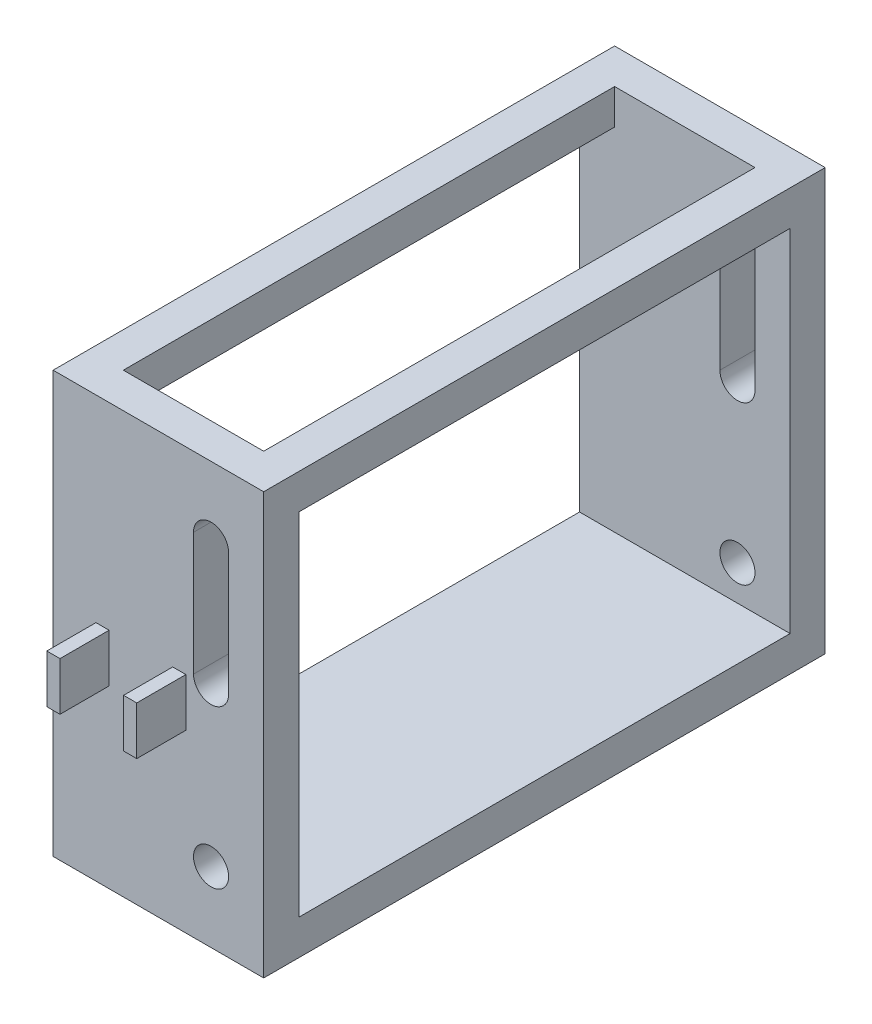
ISO-10303-21;
HEADER;
FILE_DESCRIPTION(('STEP AP214'),'2;1');
FILE_NAME('part.step','',(''),(''),'','','');
FILE_SCHEMA(('AUTOMOTIVE_DESIGN { 1 0 10303 214 1 1 1 1 }'));
ENDSEC;
DATA;
#1=APPLICATION_CONTEXT('core data for automotive mechanical design processes');
#2=APPLICATION_PROTOCOL_DEFINITION('international standard','automotive_design',2000,#1);
#3=PRODUCT_CONTEXT('',#1,'mechanical');
#4=PRODUCT('Part','Part','',(#3));
#5=PRODUCT_RELATED_PRODUCT_CATEGORY('part','',(#4));
#6=PRODUCT_DEFINITION_FORMATION('','',#4);
#7=PRODUCT_DEFINITION_CONTEXT('part definition',#1,'design');
#8=PRODUCT_DEFINITION('design','',#6,#7);
#9=PRODUCT_DEFINITION_SHAPE('','',#8);
#10=(LENGTH_UNIT() NAMED_UNIT(*) SI_UNIT(.MILLI.,.METRE.));
#11=(NAMED_UNIT(*) PLANE_ANGLE_UNIT() SI_UNIT($,.RADIAN.));
#12=(NAMED_UNIT(*) SI_UNIT($,.STERADIAN.) SOLID_ANGLE_UNIT());
#13=UNCERTAINTY_MEASURE_WITH_UNIT(LENGTH_MEASURE(1.E-05),#10,'distance_accuracy_value','');
#14=(GEOMETRIC_REPRESENTATION_CONTEXT(3) GLOBAL_UNCERTAINTY_ASSIGNED_CONTEXT((#13)) GLOBAL_UNIT_ASSIGNED_CONTEXT((#10,
#11,#12)) REPRESENTATION_CONTEXT('',''));
#15=CARTESIAN_POINT('',(0.,0.,0.));
#16=DIRECTION('',(0.,0.,1.));
#17=DIRECTION('',(1.,0.,0.));
#18=AXIS2_PLACEMENT_3D('',#15,#16,#17);
#19=CARTESIAN_POINT('',(0.,12.7,0.));
#20=DIRECTION('',(0.,0.,-1.));
#21=DIRECTION('',(-1.,0.,0.));
#22=AXIS2_PLACEMENT_3D('',#19,#20,#21);
#23=PLANE('',#22);
#24=DIRECTION('',(0.,-1.,0.));
#25=VECTOR('',#24,1.);
#26=CARTESIAN_POINT('',(15.494,81.026,0.));
#27=LINE('',#26,#25);
#28=CARTESIAN_POINT('',(15.494,81.026,0.));
#29=VERTEX_POINT('',#28);
#30=CARTESIAN_POINT('',(15.494,63.5635,0.));
#31=VERTEX_POINT('',#30);
#32=EDGE_CURVE('E413',#29,#31,#27,.T.);
#33=ORIENTED_EDGE('',*,*,#32,.F.);
#34=DIRECTION('',(-1.,0.,0.));
#35=VECTOR('',#34,1.);
#36=CARTESIAN_POINT('',(15.494,81.026,0.));
#37=LINE('',#36,#35);
#38=CARTESIAN_POINT('',(20.2565,81.026,0.));
#39=VERTEX_POINT('',#38);
#40=EDGE_CURVE('E419',#39,#29,#37,.T.);
#41=ORIENTED_EDGE('',*,*,#40,.F.);
#42=DIRECTION('',(0.,1.,0.));
#43=VECTOR('',#42,1.);
#44=CARTESIAN_POINT('',(20.2565,81.026,0.));
#45=LINE('',#44,#43);
#46=CARTESIAN_POINT('',(20.2565,63.5635,0.));
#47=VERTEX_POINT('',#46);
#48=EDGE_CURVE('E436',#47,#39,#45,.T.);
#49=ORIENTED_EDGE('',*,*,#48,.F.);
#50=DIRECTION('',(1.,0.,0.));
#51=VECTOR('',#50,1.);
#52=CARTESIAN_POINT('',(15.494,63.5635,0.));
#53=LINE('',#52,#51);
#54=EDGE_CURVE('E432',#31,#47,#53,.T.);
#55=ORIENTED_EDGE('',*,*,#54,.F.);
#56=EDGE_LOOP('',(#33,#41,#49,#55));
#57=FACE_BOUND('',#56,.T.);
#58=CARTESIAN_POINT('',(57.15,25.4,0.));
#59=DIRECTION('',(0.,0.,1.));
#60=DIRECTION('',(1.,0.,0.));
#61=AXIS2_PLACEMENT_3D('',#58,#59,#60);
#62=CIRCLE('',#61,6.35);
#63=CARTESIAN_POINT('',(63.5,25.4,0.));
#64=VERTEX_POINT('',#63);
#65=EDGE_CURVE('E464',#64,#64,#62,.T.);
#66=ORIENTED_EDGE('',*,*,#65,.F.);
#67=EDGE_LOOP('',(#66));
#68=FACE_BOUND('',#67,.T.);
#69=DIRECTION('',(0.,-1.,0.));
#70=VECTOR('',#69,1.);
#71=CARTESIAN_POINT('',(50.8,127.,0.));
#72=LINE('',#71,#70);
#73=CARTESIAN_POINT('',(50.8,127.,0.));
#74=VERTEX_POINT('',#73);
#75=CARTESIAN_POINT('',(50.8,82.55,0.));
#76=VERTEX_POINT('',#75);
#77=EDGE_CURVE('E489',#74,#76,#72,.T.);
#78=ORIENTED_EDGE('',*,*,#77,.F.);
#79=CARTESIAN_POINT('',(57.15,127.,0.));
#80=DIRECTION('',(0.,0.,1.));
#81=DIRECTION('',(1.,0.,0.));
#82=AXIS2_PLACEMENT_3D('',#79,#80,#81);
#83=CIRCLE('',#82,6.34999999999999);
#84=CARTESIAN_POINT('',(63.5,127.,0.));
#85=VERTEX_POINT('',#84);
#86=EDGE_CURVE('E458',#85,#74,#83,.T.);
#87=ORIENTED_EDGE('',*,*,#86,.F.);
#88=DIRECTION('',(0.,1.,0.));
#89=VECTOR('',#88,1.);
#90=CARTESIAN_POINT('',(63.5,127.,0.));
#91=LINE('',#90,#89);
#92=CARTESIAN_POINT('',(63.5,82.55,0.));
#93=VERTEX_POINT('',#92);
#94=EDGE_CURVE('E474',#93,#85,#91,.T.);
#95=ORIENTED_EDGE('',*,*,#94,.F.);
#96=CARTESIAN_POINT('',(57.15,82.55,0.));
#97=DIRECTION('',(0.,0.,1.));
#98=DIRECTION('',(1.,0.,0.));
#99=AXIS2_PLACEMENT_3D('',#96,#97,#98);
#100=CIRCLE('',#99,6.34999999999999);
#101=EDGE_CURVE('E493',#76,#93,#100,.T.);
#102=ORIENTED_EDGE('',*,*,#101,.F.);
#103=EDGE_LOOP('',(#78,#87,#95,#102));
#104=FACE_BOUND('',#103,.T.);
#105=DIRECTION('',(1.,0.,0.));
#106=VECTOR('',#105,1.);
#107=CARTESIAN_POINT('',(0.,0.,0.));
#108=LINE('',#107,#106);
#109=CARTESIAN_POINT('',(0.,0.,0.));
#110=VERTEX_POINT('',#109);
#111=CARTESIAN_POINT('',(76.2,0.,0.));
#112=VERTEX_POINT('',#111);
#113=EDGE_CURVE('E644',#110,#112,#108,.T.);
#114=ORIENTED_EDGE('',*,*,#113,.T.);
#115=DIRECTION('',(0.,-1.,0.));
#116=VECTOR('',#115,1.);
#117=CARTESIAN_POINT('',(76.2,12.7,0.));
#118=LINE('',#117,#116);
#119=CARTESIAN_POINT('',(76.2,152.4,0.));
#120=VERTEX_POINT('',#119);
#121=EDGE_CURVE('E659',#120,#112,#118,.T.);
#122=ORIENTED_EDGE('',*,*,#121,.F.);
#123=DIRECTION('',(1.,0.,0.));
#124=VECTOR('',#123,1.);
#125=CARTESIAN_POINT('',(0.,152.4,0.));
#126=LINE('',#125,#124);
#127=CARTESIAN_POINT('',(0.,152.4,0.));
#128=VERTEX_POINT('',#127);
#129=EDGE_CURVE('E583',#128,#120,#126,.T.);
#130=ORIENTED_EDGE('',*,*,#129,.F.);
#131=DIRECTION('',(0.,-1.,0.));
#132=VECTOR('',#131,1.);
#133=CARTESIAN_POINT('',(0.,12.7,0.));
#134=LINE('',#133,#132);
#135=EDGE_CURVE('E663',#128,#110,#134,.T.);
#136=ORIENTED_EDGE('',*,*,#135,.T.);
#137=EDGE_LOOP('',(#114,#122,#130,#136));
#138=FACE_BOUND('',#137,.T.);
#139=DIRECTION('',(0.,-1.,0.));
#140=VECTOR('',#139,1.);
#141=CARTESIAN_POINT('',(43.27525,81.026,0.));
#142=LINE('',#141,#140);
#143=CARTESIAN_POINT('',(43.27525,81.026,0.));
#144=VERTEX_POINT('',#143);
#145=CARTESIAN_POINT('',(43.27525,63.5635,0.));
#146=VERTEX_POINT('',#145);
#147=EDGE_CURVE('E368',#144,#146,#142,.T.);
#148=ORIENTED_EDGE('',*,*,#147,.F.);
#149=DIRECTION('',(-1.,0.,0.));
#150=VECTOR('',#149,1.);
#151=CARTESIAN_POINT('',(43.27525,81.026,0.));
#152=LINE('',#151,#150);
#153=CARTESIAN_POINT('',(48.03775,81.026,0.));
#154=VERTEX_POINT('',#153);
#155=EDGE_CURVE('E374',#154,#144,#152,.T.);
#156=ORIENTED_EDGE('',*,*,#155,.F.);
#157=DIRECTION('',(0.,1.,0.));
#158=VECTOR('',#157,1.);
#159=CARTESIAN_POINT('',(48.03775,81.026,0.));
#160=LINE('',#159,#158);
#161=CARTESIAN_POINT('',(48.03775,63.5635,0.));
#162=VERTEX_POINT('',#161);
#163=EDGE_CURVE('E391',#162,#154,#160,.T.);
#164=ORIENTED_EDGE('',*,*,#163,.F.);
#165=DIRECTION('',(1.,0.,0.));
#166=VECTOR('',#165,1.);
#167=CARTESIAN_POINT('',(43.27525,63.5635,0.));
#168=LINE('',#167,#166);
#169=EDGE_CURVE('E387',#146,#162,#168,.T.);
#170=ORIENTED_EDGE('',*,*,#169,.F.);
#171=EDGE_LOOP('',(#148,#156,#164,#170));
#172=FACE_BOUND('',#171,.T.);
#173=ADVANCED_FACE('F39',(#57,#68,#104,#138,#172),#23,.F.);
#174=CARTESIAN_POINT('',(0.,12.7,0.));
#175=DIRECTION('',(0.,-1.,0.));
#176=DIRECTION('',(0.,0.,-1.));
#177=AXIS2_PLACEMENT_3D('',#174,#175,#176);
#178=PLANE('',#177);
#179=DIRECTION('',(-1.,0.,0.));
#180=VECTOR('',#179,1.);
#181=CARTESIAN_POINT('',(0.,12.7,-12.7));
#182=LINE('',#181,#180);
#183=CARTESIAN_POINT('',(76.2,12.7,-12.7));
#184=VERTEX_POINT('',#183);
#185=CARTESIAN_POINT('',(0.,12.7,-12.7));
#186=VERTEX_POINT('',#185);
#187=EDGE_CURVE('E601',#184,#186,#182,.T.);
#188=ORIENTED_EDGE('',*,*,#187,.F.);
#189=DIRECTION('',(0.,0.,-1.));
#190=VECTOR('',#189,1.);
#191=CARTESIAN_POINT('',(76.2,12.7,0.));
#192=LINE('',#191,#190);
#193=CARTESIAN_POINT('',(76.2,12.7,-190.5));
#194=VERTEX_POINT('',#193);
#195=EDGE_CURVE('E636',#184,#194,#192,.T.);
#196=ORIENTED_EDGE('',*,*,#195,.T.);
#197=DIRECTION('',(1.,0.,0.));
#198=VECTOR('',#197,1.);
#199=CARTESIAN_POINT('',(0.,12.7,-190.5));
#200=LINE('',#199,#198);
#201=CARTESIAN_POINT('',(0.,12.7,-190.5));
#202=VERTEX_POINT('',#201);
#203=EDGE_CURVE('E617',#202,#194,#200,.T.);
#204=ORIENTED_EDGE('',*,*,#203,.F.);
#205=DIRECTION('',(0.,0.,1.));
#206=VECTOR('',#205,1.);
#207=CARTESIAN_POINT('',(0.,12.7,0.));
#208=LINE('',#207,#206);
#209=EDGE_CURVE('E633',#202,#186,#208,.T.);
#210=ORIENTED_EDGE('',*,*,#209,.T.);
#211=EDGE_LOOP('',(#188,#196,#204,#210));
#212=FACE_BOUND('',#211,.T.);
#213=ADVANCED_FACE('F739',(#212),#178,.F.);
#214=CARTESIAN_POINT('',(0.,12.7,0.));
#215=DIRECTION('',(1.,0.,0.));
#216=DIRECTION('',(0.,0.,-1.));
#217=AXIS2_PLACEMENT_3D('',#214,#215,#216);
#218=PLANE('',#217);
#219=DIRECTION('',(0.,-1.,0.));
#220=VECTOR('',#219,1.);
#221=CARTESIAN_POINT('',(0.,139.7,-190.5));
#222=LINE('',#221,#220);
#223=CARTESIAN_POINT('',(0.,139.7,-190.5));
#224=VERTEX_POINT('',#223);
#225=EDGE_CURVE('E628',#224,#202,#222,.T.);
#226=ORIENTED_EDGE('',*,*,#225,.F.);
#227=DIRECTION('',(0.,0.,1.));
#228=VECTOR('',#227,1.);
#229=CARTESIAN_POINT('',(0.,139.7,-203.2));
#230=LINE('',#229,#228);
#231=CARTESIAN_POINT('',(0.,139.7,-12.7));
#232=VERTEX_POINT('',#231);
#233=EDGE_CURVE('E573',#224,#232,#230,.T.);
#234=ORIENTED_EDGE('',*,*,#233,.T.);
#235=DIRECTION('',(0.,-1.,0.));
#236=VECTOR('',#235,1.);
#237=CARTESIAN_POINT('',(0.,139.7,-12.7));
#238=LINE('',#237,#236);
#239=EDGE_CURVE('E605',#232,#186,#238,.T.);
#240=ORIENTED_EDGE('',*,*,#239,.T.);
#241=ORIENTED_EDGE('',*,*,#209,.F.);
#242=EDGE_LOOP('',(#226,#234,#240,#241));
#243=FACE_BOUND('',#242,.T.);
#244=DIRECTION('',(0.,0.,1.));
#245=VECTOR('',#244,1.);
#246=CARTESIAN_POINT('',(0.,0.,0.));
#247=LINE('',#246,#245);
#248=CARTESIAN_POINT('',(0.,0.,-203.2));
#249=VERTEX_POINT('',#248);
#250=EDGE_CURVE('E632',#249,#110,#247,.T.);
#251=ORIENTED_EDGE('',*,*,#250,.T.);
#252=ORIENTED_EDGE('',*,*,#135,.F.);
#253=DIRECTION('',(0.,0.,1.));
#254=VECTOR('',#253,1.);
#255=CARTESIAN_POINT('',(0.,152.4,-203.2));
#256=LINE('',#255,#254);
#257=CARTESIAN_POINT('',(0.,152.4,-203.2));
#258=VERTEX_POINT('',#257);
#259=EDGE_CURVE('E578',#258,#128,#256,.T.);
#260=ORIENTED_EDGE('',*,*,#259,.F.);
#261=DIRECTION('',(0.,-1.,0.));
#262=VECTOR('',#261,1.);
#263=CARTESIAN_POINT('',(0.,12.7,-203.2));
#264=LINE('',#263,#262);
#265=EDGE_CURVE('E640',#258,#249,#264,.T.);
#266=ORIENTED_EDGE('',*,*,#265,.T.);
#267=EDGE_LOOP('',(#251,#252,#260,#266));
#268=FACE_BOUND('',#267,.T.);
#269=ADVANCED_FACE('F41',(#243,#268),#218,.F.);
#270=CARTESIAN_POINT('',(76.2,12.7,0.));
#271=DIRECTION('',(-1.,0.,0.));
#272=DIRECTION('',(0.,0.,1.));
#273=AXIS2_PLACEMENT_3D('',#270,#271,#272);
#274=PLANE('',#273);
#275=DIRECTION('',(0.,-1.,0.));
#276=VECTOR('',#275,1.);
#277=CARTESIAN_POINT('',(76.2,12.7,-203.2));
#278=LINE('',#277,#276);
#279=CARTESIAN_POINT('',(76.2,152.4,-203.2));
#280=VERTEX_POINT('',#279);
#281=CARTESIAN_POINT('',(76.2,0.,-203.2));
#282=VERTEX_POINT('',#281);
#283=EDGE_CURVE('E655',#280,#282,#278,.T.);
#284=ORIENTED_EDGE('',*,*,#283,.F.);
#285=DIRECTION('',(0.,0.,-1.));
#286=VECTOR('',#285,1.);
#287=CARTESIAN_POINT('',(76.2,152.4,0.));
#288=LINE('',#287,#286);
#289=EDGE_CURVE('E587',#120,#280,#288,.T.);
#290=ORIENTED_EDGE('',*,*,#289,.F.);
#291=ORIENTED_EDGE('',*,*,#121,.T.);
#292=DIRECTION('',(0.,0.,-1.));
#293=VECTOR('',#292,1.);
#294=CARTESIAN_POINT('',(76.2,0.,0.));
#295=LINE('',#294,#293);
#296=EDGE_CURVE('E647',#112,#282,#295,.T.);
#297=ORIENTED_EDGE('',*,*,#296,.T.);
#298=EDGE_LOOP('',(#284,#290,#291,#297));
#299=FACE_BOUND('',#298,.T.);
#300=DIRECTION('',(0.,0.,-1.));
#301=VECTOR('',#300,1.);
#302=CARTESIAN_POINT('',(76.2,139.7,0.));
#303=LINE('',#302,#301);
#304=CARTESIAN_POINT('',(76.2,139.7,-12.7));
#305=VERTEX_POINT('',#304);
#306=CARTESIAN_POINT('',(76.2,139.7,-190.5));
#307=VERTEX_POINT('',#306);
#308=EDGE_CURVE('E579',#305,#307,#303,.T.);
#309=ORIENTED_EDGE('',*,*,#308,.T.);
#310=DIRECTION('',(0.,-1.,0.));
#311=VECTOR('',#310,1.);
#312=CARTESIAN_POINT('',(76.2,139.7,-190.5));
#313=LINE('',#312,#311);
#314=EDGE_CURVE('E621',#307,#194,#313,.T.);
#315=ORIENTED_EDGE('',*,*,#314,.T.);
#316=ORIENTED_EDGE('',*,*,#195,.F.);
#317=DIRECTION('',(0.,-1.,0.));
#318=VECTOR('',#317,1.);
#319=CARTESIAN_POINT('',(76.2,139.7,-12.7));
#320=LINE('',#319,#318);
#321=EDGE_CURVE('E613',#305,#184,#320,.T.);
#322=ORIENTED_EDGE('',*,*,#321,.F.);
#323=EDGE_LOOP('',(#309,#315,#316,#322));
#324=FACE_BOUND('',#323,.T.);
#325=ADVANCED_FACE('F736',(#299,#324),#274,.F.);
#326=CARTESIAN_POINT('',(0.,12.7,-203.2));
#327=DIRECTION('',(0.,0.,1.));
#328=DIRECTION('',(1.,0.,0.));
#329=AXIS2_PLACEMENT_3D('',#326,#327,#328);
#330=PLANE('',#329);
#331=DIRECTION('',(-1.,0.,0.));
#332=VECTOR('',#331,1.);
#333=CARTESIAN_POINT('',(43.27525,81.026,-203.2));
#334=LINE('',#333,#332);
#335=CARTESIAN_POINT('',(48.03775,81.026,-203.2));
#336=VERTEX_POINT('',#335);
#337=CARTESIAN_POINT('',(43.27525,81.026,-203.2));
#338=VERTEX_POINT('',#337);
#339=EDGE_CURVE('E312',#336,#338,#334,.T.);
#340=ORIENTED_EDGE('',*,*,#339,.T.);
#341=DIRECTION('',(0.,-1.,0.));
#342=VECTOR('',#341,1.);
#343=CARTESIAN_POINT('',(43.27525,81.026,-203.2));
#344=LINE('',#343,#342);
#345=CARTESIAN_POINT('',(43.27525,63.5635,-203.2));
#346=VERTEX_POINT('',#345);
#347=EDGE_CURVE('E280',#338,#346,#344,.T.);
#348=ORIENTED_EDGE('',*,*,#347,.T.);
#349=DIRECTION('',(1.,0.,0.));
#350=VECTOR('',#349,1.);
#351=CARTESIAN_POINT('',(43.27525,63.5635,-203.2));
#352=LINE('',#351,#350);
#353=CARTESIAN_POINT('',(48.03775,63.5635,-203.2));
#354=VERTEX_POINT('',#353);
#355=EDGE_CURVE('E298',#346,#354,#352,.T.);
#356=ORIENTED_EDGE('',*,*,#355,.T.);
#357=DIRECTION('',(0.,1.,0.));
#358=VECTOR('',#357,1.);
#359=CARTESIAN_POINT('',(48.03775,81.026,-203.2));
#360=LINE('',#359,#358);
#361=EDGE_CURVE('E56',#354,#336,#360,.T.);
#362=ORIENTED_EDGE('',*,*,#361,.T.);
#363=EDGE_LOOP('',(#340,#348,#356,#362));
#364=FACE_BOUND('',#363,.T.);
#365=DIRECTION('',(-1.,0.,0.));
#366=VECTOR('',#365,1.);
#367=CARTESIAN_POINT('',(15.494,81.026,-203.2));
#368=LINE('',#367,#366);
#369=CARTESIAN_POINT('',(20.2565,81.026,-203.2));
#370=VERTEX_POINT('',#369);
#371=CARTESIAN_POINT('',(15.494,81.026,-203.2));
#372=VERTEX_POINT('',#371);
#373=EDGE_CURVE('E348',#370,#372,#368,.T.);
#374=ORIENTED_EDGE('',*,*,#373,.T.);
#375=DIRECTION('',(0.,-1.,0.));
#376=VECTOR('',#375,1.);
#377=CARTESIAN_POINT('',(15.494,81.026,-203.2));
#378=LINE('',#377,#376);
#379=CARTESIAN_POINT('',(15.494,63.5635,-203.2));
#380=VERTEX_POINT('',#379);
#381=EDGE_CURVE('E286',#372,#380,#378,.T.);
#382=ORIENTED_EDGE('',*,*,#381,.T.);
#383=DIRECTION('',(1.,0.,0.));
#384=VECTOR('',#383,1.);
#385=CARTESIAN_POINT('',(15.494,63.5635,-203.2));
#386=LINE('',#385,#384);
#387=CARTESIAN_POINT('',(20.2565,63.5635,-203.2));
#388=VERTEX_POINT('',#387);
#389=EDGE_CURVE('E332',#380,#388,#386,.T.);
#390=ORIENTED_EDGE('',*,*,#389,.T.);
#391=DIRECTION('',(0.,1.,0.));
#392=VECTOR('',#391,1.);
#393=CARTESIAN_POINT('',(20.2565,81.026,-203.2));
#394=LINE('',#393,#392);
#395=EDGE_CURVE('E64',#388,#370,#394,.T.);
#396=ORIENTED_EDGE('',*,*,#395,.T.);
#397=EDGE_LOOP('',(#374,#382,#390,#396));
#398=FACE_BOUND('',#397,.T.);
#399=CARTESIAN_POINT('',(57.15,25.4,-203.2));
#400=DIRECTION('',(0.,0.,1.));
#401=DIRECTION('',(1.,0.,0.));
#402=AXIS2_PLACEMENT_3D('',#399,#400,#401);
#403=CIRCLE('',#402,6.35);
#404=CARTESIAN_POINT('',(63.5,25.4,-203.2));
#405=VERTEX_POINT('',#404);
#406=EDGE_CURVE('E459',#405,#405,#403,.T.);
#407=ORIENTED_EDGE('',*,*,#406,.T.);
#408=EDGE_LOOP('',(#407));
#409=FACE_BOUND('',#408,.T.);
#410=DIRECTION('',(0.,1.,0.));
#411=VECTOR('',#410,1.);
#412=CARTESIAN_POINT('',(63.5,127.,-203.2));
#413=LINE('',#412,#411);
#414=CARTESIAN_POINT('',(63.5,82.55,-203.2));
#415=VERTEX_POINT('',#414);
#416=CARTESIAN_POINT('',(63.5,127.,-203.2));
#417=VERTEX_POINT('',#416);
#418=EDGE_CURVE('E482',#415,#417,#413,.T.);
#419=ORIENTED_EDGE('',*,*,#418,.T.);
#420=CARTESIAN_POINT('',(57.15,127.,-203.2));
#421=DIRECTION('',(0.,0.,1.));
#422=DIRECTION('',(1.,0.,0.));
#423=AXIS2_PLACEMENT_3D('',#420,#421,#422);
#424=CIRCLE('',#423,6.34999999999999);
#425=CARTESIAN_POINT('',(50.8,127.,-203.2));
#426=VERTEX_POINT('',#425);
#427=EDGE_CURVE('E469',#417,#426,#424,.T.);
#428=ORIENTED_EDGE('',*,*,#427,.T.);
#429=DIRECTION('',(0.,-1.,0.));
#430=VECTOR('',#429,1.);
#431=CARTESIAN_POINT('',(50.8,127.,-203.2));
#432=LINE('',#431,#430);
#433=CARTESIAN_POINT('',(50.8,82.55,-203.2));
#434=VERTEX_POINT('',#433);
#435=EDGE_CURVE('E473',#426,#434,#432,.T.);
#436=ORIENTED_EDGE('',*,*,#435,.T.);
#437=CARTESIAN_POINT('',(57.15,82.55,-203.2));
#438=DIRECTION('',(0.,0.,1.));
#439=DIRECTION('',(1.,0.,0.));
#440=AXIS2_PLACEMENT_3D('',#437,#438,#439);
#441=CIRCLE('',#440,6.34999999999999);
#442=EDGE_CURVE('E478',#434,#415,#441,.T.);
#443=ORIENTED_EDGE('',*,*,#442,.T.);
#444=EDGE_LOOP('',(#419,#428,#436,#443));
#445=FACE_BOUND('',#444,.T.);
#446=DIRECTION('',(-1.,0.,0.));
#447=VECTOR('',#446,1.);
#448=CARTESIAN_POINT('',(0.,0.,-203.2));
#449=LINE('',#448,#447);
#450=EDGE_CURVE('E637',#282,#249,#449,.T.);
#451=ORIENTED_EDGE('',*,*,#450,.T.);
#452=ORIENTED_EDGE('',*,*,#265,.F.);
#453=DIRECTION('',(-1.,0.,0.));
#454=VECTOR('',#453,1.);
#455=CARTESIAN_POINT('',(76.2,152.4,-203.2));
#456=LINE('',#455,#454);
#457=EDGE_CURVE('E574',#280,#258,#456,.T.);
#458=ORIENTED_EDGE('',*,*,#457,.F.);
#459=ORIENTED_EDGE('',*,*,#283,.T.);
#460=EDGE_LOOP('',(#451,#452,#458,#459));
#461=FACE_BOUND('',#460,.T.);
#462=ADVANCED_FACE('F753',(#364,#398,#409,#445,#461),#330,.F.);
#463=CARTESIAN_POINT('',(0.,0.,0.));
#464=DIRECTION('',(0.,-1.,0.));
#465=DIRECTION('',(0.,0.,-1.));
#466=AXIS2_PLACEMENT_3D('',#463,#464,#465);
#467=PLANE('',#466);
#468=ORIENTED_EDGE('',*,*,#250,.F.);
#469=ORIENTED_EDGE('',*,*,#450,.F.);
#470=ORIENTED_EDGE('',*,*,#296,.F.);
#471=ORIENTED_EDGE('',*,*,#113,.F.);
#472=EDGE_LOOP('',(#468,#469,#470,#471));
#473=FACE_BOUND('',#472,.T.);
#474=ADVANCED_FACE('F750',(#473),#467,.T.);
#475=CARTESIAN_POINT('',(0.,139.7,-190.5));
#476=DIRECTION('',(0.,0.,-1.));
#477=DIRECTION('',(-1.,0.,0.));
#478=AXIS2_PLACEMENT_3D('',#475,#476,#477);
#479=PLANE('',#478);
#480=CARTESIAN_POINT('',(57.15,25.4,-190.5));
#481=DIRECTION('',(0.,0.,-1.));
#482=DIRECTION('',(-1.,0.,0.));
#483=AXIS2_PLACEMENT_3D('',#480,#481,#482);
#484=CIRCLE('',#483,6.35);
#485=CARTESIAN_POINT('',(50.8,25.4,-190.5));
#486=VERTEX_POINT('',#485);
#487=EDGE_CURVE('E532',#486,#486,#484,.T.);
#488=ORIENTED_EDGE('',*,*,#487,.T.);
#489=EDGE_LOOP('',(#488));
#490=FACE_BOUND('',#489,.T.);
#491=DIRECTION('',(0.,1.,0.));
#492=VECTOR('',#491,1.);
#493=CARTESIAN_POINT('',(50.8,139.7,-190.5));
#494=LINE('',#493,#492);
#495=CARTESIAN_POINT('',(50.8,82.55,-190.5));
#496=VERTEX_POINT('',#495);
#497=CARTESIAN_POINT('',(50.8,127.,-190.5));
#498=VERTEX_POINT('',#497);
#499=EDGE_CURVE('E463',#496,#498,#494,.T.);
#500=ORIENTED_EDGE('',*,*,#499,.T.);
#501=CARTESIAN_POINT('',(57.15,127.,-190.5));
#502=DIRECTION('',(0.,0.,-1.));
#503=DIRECTION('',(-1.,0.,0.));
#504=AXIS2_PLACEMENT_3D('',#501,#502,#503);
#505=CIRCLE('',#504,6.34999999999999);
#506=CARTESIAN_POINT('',(63.5,127.,-190.5));
#507=VERTEX_POINT('',#506);
#508=EDGE_CURVE('E528',#498,#507,#505,.T.);
#509=ORIENTED_EDGE('',*,*,#508,.T.);
#510=DIRECTION('',(0.,-1.,0.));
#511=VECTOR('',#510,1.);
#512=CARTESIAN_POINT('',(63.5,139.7,-190.5));
#513=LINE('',#512,#511);
#514=CARTESIAN_POINT('',(63.5,82.55,-190.5));
#515=VERTEX_POINT('',#514);
#516=EDGE_CURVE('E524',#507,#515,#513,.T.);
#517=ORIENTED_EDGE('',*,*,#516,.T.);
#518=CARTESIAN_POINT('',(57.15,82.55,-190.5));
#519=DIRECTION('',(0.,0.,-1.));
#520=DIRECTION('',(-1.,0.,0.));
#521=AXIS2_PLACEMENT_3D('',#518,#519,#520);
#522=CIRCLE('',#521,6.34999999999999);
#523=EDGE_CURVE('E520',#515,#496,#522,.T.);
#524=ORIENTED_EDGE('',*,*,#523,.T.);
#525=EDGE_LOOP('',(#500,#509,#517,#524));
#526=FACE_BOUND('',#525,.T.);
#527=ORIENTED_EDGE('',*,*,#203,.T.);
#528=ORIENTED_EDGE('',*,*,#314,.F.);
#529=DIRECTION('',(1.,0.,0.));
#530=VECTOR('',#529,1.);
#531=CARTESIAN_POINT('',(0.,139.7,-190.5));
#532=LINE('',#531,#530);
#533=CARTESIAN_POINT('',(63.5,139.7,-190.5));
#534=VERTEX_POINT('',#533);
#535=EDGE_CURVE('E591',#534,#307,#532,.T.);
#536=ORIENTED_EDGE('',*,*,#535,.F.);
#537=DIRECTION('',(0.,-1.,0.));
#538=VECTOR('',#537,1.);
#539=CARTESIAN_POINT('',(63.5,152.4,-190.5));
#540=LINE('',#539,#538);
#541=CARTESIAN_POINT('',(63.5,152.4,-190.5));
#542=VERTEX_POINT('',#541);
#543=EDGE_CURVE('E561',#542,#534,#540,.T.);
#544=ORIENTED_EDGE('',*,*,#543,.F.);
#545=DIRECTION('',(-1.,0.,0.));
#546=VECTOR('',#545,1.);
#547=CARTESIAN_POINT('',(12.7,152.4,-190.5));
#548=LINE('',#547,#546);
#549=CARTESIAN_POINT('',(12.7,152.4,-190.5));
#550=VERTEX_POINT('',#549);
#551=EDGE_CURVE('E548',#542,#550,#548,.T.);
#552=ORIENTED_EDGE('',*,*,#551,.T.);
#553=DIRECTION('',(0.,-1.,0.));
#554=VECTOR('',#553,1.);
#555=CARTESIAN_POINT('',(12.7,152.4,-190.5));
#556=LINE('',#555,#554);
#557=CARTESIAN_POINT('',(12.7,139.7,-190.5));
#558=VERTEX_POINT('',#557);
#559=EDGE_CURVE('E551',#550,#558,#556,.T.);
#560=ORIENTED_EDGE('',*,*,#559,.T.);
#561=DIRECTION('',(1.,0.,0.));
#562=VECTOR('',#561,1.);
#563=CARTESIAN_POINT('',(0.,139.7,-190.5));
#564=LINE('',#563,#562);
#565=EDGE_CURVE('E618',#224,#558,#564,.T.);
#566=ORIENTED_EDGE('',*,*,#565,.F.);
#567=ORIENTED_EDGE('',*,*,#225,.T.);
#568=EDGE_LOOP('',(#527,#528,#536,#544,#552,#560,#566,#567));
#569=FACE_BOUND('',#568,.T.);
#570=ADVANCED_FACE('F717',(#490,#526,#569),#479,.F.);
#571=CARTESIAN_POINT('',(0.,139.7,-12.7));
#572=DIRECTION('',(0.,0.,1.));
#573=DIRECTION('',(1.,0.,0.));
#574=AXIS2_PLACEMENT_3D('',#571,#572,#573);
#575=PLANE('',#574);
#576=CARTESIAN_POINT('',(57.15,25.4,-12.7));
#577=DIRECTION('',(0.,0.,1.));
#578=DIRECTION('',(1.,0.,0.));
#579=AXIS2_PLACEMENT_3D('',#576,#577,#578);
#580=CIRCLE('',#579,6.35);
#581=CARTESIAN_POINT('',(63.5,25.4,-12.7));
#582=VERTEX_POINT('',#581);
#583=EDGE_CURVE('E43',#582,#582,#580,.T.);
#584=ORIENTED_EDGE('',*,*,#583,.T.);
#585=EDGE_LOOP('',(#584));
#586=FACE_BOUND('',#585,.T.);
#587=DIRECTION('',(0.,1.,0.));
#588=VECTOR('',#587,1.);
#589=CARTESIAN_POINT('',(63.5,139.7,-12.7));
#590=LINE('',#589,#588);
#591=CARTESIAN_POINT('',(63.5,82.55,-12.7));
#592=VERTEX_POINT('',#591);
#593=CARTESIAN_POINT('',(63.5,127.,-12.7));
#594=VERTEX_POINT('',#593);
#595=EDGE_CURVE('E49',#592,#594,#590,.T.);
#596=ORIENTED_EDGE('',*,*,#595,.T.);
#597=CARTESIAN_POINT('',(57.15,127.,-12.7));
#598=DIRECTION('',(0.,0.,1.));
#599=DIRECTION('',(1.,0.,0.));
#600=AXIS2_PLACEMENT_3D('',#597,#598,#599);
#601=CIRCLE('',#600,6.34999999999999);
#602=CARTESIAN_POINT('',(50.8,127.,-12.7));
#603=VERTEX_POINT('',#602);
#604=EDGE_CURVE('E11',#594,#603,#601,.T.);
#605=ORIENTED_EDGE('',*,*,#604,.T.);
#606=DIRECTION('',(0.,-1.,0.));
#607=VECTOR('',#606,1.);
#608=CARTESIAN_POINT('',(50.8,139.7,-12.7));
#609=LINE('',#608,#607);
#610=CARTESIAN_POINT('',(50.8,82.55,-12.7));
#611=VERTEX_POINT('',#610);
#612=EDGE_CURVE('E667',#603,#611,#609,.T.);
#613=ORIENTED_EDGE('',*,*,#612,.T.);
#614=CARTESIAN_POINT('',(57.15,82.55,-12.7));
#615=DIRECTION('',(0.,0.,1.));
#616=DIRECTION('',(1.,0.,0.));
#617=AXIS2_PLACEMENT_3D('',#614,#615,#616);
#618=CIRCLE('',#617,6.34999999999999);
#619=EDGE_CURVE('E671',#611,#592,#618,.T.);
#620=ORIENTED_EDGE('',*,*,#619,.T.);
#621=EDGE_LOOP('',(#596,#605,#613,#620));
#622=FACE_BOUND('',#621,.T.);
#623=ORIENTED_EDGE('',*,*,#187,.T.);
#624=ORIENTED_EDGE('',*,*,#239,.F.);
#625=DIRECTION('',(-1.,0.,0.));
#626=VECTOR('',#625,1.);
#627=CARTESIAN_POINT('',(0.,139.7,-12.7));
#628=LINE('',#627,#626);
#629=CARTESIAN_POINT('',(12.7,139.7,-12.7));
#630=VERTEX_POINT('',#629);
#631=EDGE_CURVE('E606',#630,#232,#628,.T.);
#632=ORIENTED_EDGE('',*,*,#631,.F.);
#633=DIRECTION('',(0.,-1.,0.));
#634=VECTOR('',#633,1.);
#635=CARTESIAN_POINT('',(12.7,152.4,-12.7));
#636=LINE('',#635,#634);
#637=CARTESIAN_POINT('',(12.7,152.4,-12.7));
#638=VERTEX_POINT('',#637);
#639=EDGE_CURVE('E569',#638,#630,#636,.T.);
#640=ORIENTED_EDGE('',*,*,#639,.F.);
#641=DIRECTION('',(1.,0.,0.));
#642=VECTOR('',#641,1.);
#643=CARTESIAN_POINT('',(12.7,152.4,-12.7));
#644=LINE('',#643,#642);
#645=CARTESIAN_POINT('',(63.5,152.4,-12.7));
#646=VERTEX_POINT('',#645);
#647=EDGE_CURVE('E540',#638,#646,#644,.T.);
#648=ORIENTED_EDGE('',*,*,#647,.T.);
#649=DIRECTION('',(0.,-1.,0.));
#650=VECTOR('',#649,1.);
#651=CARTESIAN_POINT('',(63.5,152.4,-12.7));
#652=LINE('',#651,#650);
#653=CARTESIAN_POINT('',(63.5,139.7,-12.7));
#654=VERTEX_POINT('',#653);
#655=EDGE_CURVE('E565',#646,#654,#652,.T.);
#656=ORIENTED_EDGE('',*,*,#655,.T.);
#657=EDGE_CURVE('E602',#305,#654,#628,.T.);
#658=ORIENTED_EDGE('',*,*,#657,.F.);
#659=ORIENTED_EDGE('',*,*,#321,.T.);
#660=EDGE_LOOP('',(#623,#624,#632,#640,#648,#656,#658,#659));
#661=FACE_BOUND('',#660,.T.);
#662=ADVANCED_FACE('F678',(#586,#622,#661),#575,.F.);
#663=CARTESIAN_POINT('',(0.,139.7,0.));
#664=DIRECTION('',(0.,1.,0.));
#665=DIRECTION('',(0.,0.,1.));
#666=AXIS2_PLACEMENT_3D('',#663,#664,#665);
#667=PLANE('',#666);
#668=ORIENTED_EDGE('',*,*,#233,.F.);
#669=ORIENTED_EDGE('',*,*,#565,.T.);
#670=DIRECTION('',(0.,0.,1.));
#671=VECTOR('',#670,1.);
#672=CARTESIAN_POINT('',(12.7,139.7,-190.5));
#673=LINE('',#672,#671);
#674=EDGE_CURVE('E536',#558,#630,#673,.T.);
#675=ORIENTED_EDGE('',*,*,#674,.T.);
#676=ORIENTED_EDGE('',*,*,#631,.T.);
#677=EDGE_LOOP('',(#668,#669,#675,#676));
#678=FACE_BOUND('',#677,.T.);
#679=ADVANCED_FACE('F709',(#678),#667,.F.);
#680=DIRECTION('',(0.,0.,-1.));
#681=VECTOR('',#680,1.);
#682=CARTESIAN_POINT('',(63.5,139.7,-190.5));
#683=LINE('',#682,#681);
#684=EDGE_CURVE('E541',#654,#534,#683,.T.);
#685=ORIENTED_EDGE('',*,*,#684,.T.);
#686=ORIENTED_EDGE('',*,*,#535,.T.);
#687=ORIENTED_EDGE('',*,*,#308,.F.);
#688=ORIENTED_EDGE('',*,*,#657,.T.);
#689=EDGE_LOOP('',(#685,#686,#687,#688));
#690=FACE_BOUND('',#689,.T.);
#691=ADVANCED_FACE('F734',(#690),#667,.F.);
#692=CARTESIAN_POINT('',(0.,152.4,0.));
#693=DIRECTION('',(0.,1.,0.));
#694=DIRECTION('',(0.,0.,1.));
#695=AXIS2_PLACEMENT_3D('',#692,#693,#694);
#696=PLANE('',#695);
#697=ORIENTED_EDGE('',*,*,#457,.T.);
#698=ORIENTED_EDGE('',*,*,#259,.T.);
#699=ORIENTED_EDGE('',*,*,#129,.T.);
#700=ORIENTED_EDGE('',*,*,#289,.T.);
#701=EDGE_LOOP('',(#697,#698,#699,#700));
#702=FACE_BOUND('',#701,.T.);
#703=ORIENTED_EDGE('',*,*,#647,.F.);
#704=DIRECTION('',(0.,0.,1.));
#705=VECTOR('',#704,1.);
#706=CARTESIAN_POINT('',(12.7,152.4,-190.5));
#707=LINE('',#706,#705);
#708=EDGE_CURVE('E537',#550,#638,#707,.T.);
#709=ORIENTED_EDGE('',*,*,#708,.F.);
#710=ORIENTED_EDGE('',*,*,#551,.F.);
#711=DIRECTION('',(0.,0.,-1.));
#712=VECTOR('',#711,1.);
#713=CARTESIAN_POINT('',(63.5,152.4,-190.5));
#714=LINE('',#713,#712);
#715=EDGE_CURVE('E544',#646,#542,#714,.T.);
#716=ORIENTED_EDGE('',*,*,#715,.F.);
#717=EDGE_LOOP('',(#703,#709,#710,#716));
#718=FACE_BOUND('',#717,.T.);
#719=ADVANCED_FACE('F726',(#702,#718),#696,.T.);
#720=CARTESIAN_POINT('',(12.7,152.4,-190.5));
#721=DIRECTION('',(1.,0.,0.));
#722=DIRECTION('',(0.,0.,-1.));
#723=AXIS2_PLACEMENT_3D('',#720,#721,#722);
#724=PLANE('',#723);
#725=ORIENTED_EDGE('',*,*,#674,.F.);
#726=ORIENTED_EDGE('',*,*,#559,.F.);
#727=ORIENTED_EDGE('',*,*,#708,.T.);
#728=ORIENTED_EDGE('',*,*,#639,.T.);
#729=EDGE_LOOP('',(#725,#726,#727,#728));
#730=FACE_BOUND('',#729,.T.);
#731=ADVANCED_FACE('F720',(#730),#724,.T.);
#732=CARTESIAN_POINT('',(63.5,152.4,-190.5));
#733=DIRECTION('',(-1.,0.,0.));
#734=DIRECTION('',(0.,0.,1.));
#735=AXIS2_PLACEMENT_3D('',#732,#733,#734);
#736=PLANE('',#735);
#737=ORIENTED_EDGE('',*,*,#684,.F.);
#738=ORIENTED_EDGE('',*,*,#655,.F.);
#739=ORIENTED_EDGE('',*,*,#715,.T.);
#740=ORIENTED_EDGE('',*,*,#543,.T.);
#741=EDGE_LOOP('',(#737,#738,#739,#740));
#742=FACE_BOUND('',#741,.T.);
#743=ADVANCED_FACE('F730',(#742),#736,.T.);
#744=CARTESIAN_POINT('',(50.8,127.,-203.2));
#745=DIRECTION('',(-1.,0.,0.));
#746=DIRECTION('',(0.,0.,1.));
#747=AXIS2_PLACEMENT_3D('',#744,#745,#746);
#748=PLANE('',#747);
#749=DIRECTION('',(0.,0.,1.));
#750=VECTOR('',#749,1.);
#751=CARTESIAN_POINT('',(50.8,127.,-203.2));
#752=LINE('',#751,#750);
#753=EDGE_CURVE('E486',#603,#74,#752,.T.);
#754=ORIENTED_EDGE('',*,*,#753,.T.);
#755=ORIENTED_EDGE('',*,*,#77,.T.);
#756=DIRECTION('',(0.,0.,1.));
#757=VECTOR('',#756,1.);
#758=CARTESIAN_POINT('',(50.8,82.55,-203.2));
#759=LINE('',#758,#757);
#760=EDGE_CURVE('E513',#611,#76,#759,.T.);
#761=ORIENTED_EDGE('',*,*,#760,.F.);
#762=ORIENTED_EDGE('',*,*,#612,.F.);
#763=EDGE_LOOP('',(#754,#755,#761,#762));
#764=FACE_BOUND('',#763,.T.);
#765=ADVANCED_FACE('F697',(#764),#748,.F.);
#766=CARTESIAN_POINT('',(57.15,82.55,-203.2));
#767=DIRECTION('',(0.,0.,1.));
#768=DIRECTION('',(1.,0.,0.));
#769=AXIS2_PLACEMENT_3D('',#766,#767,#768);
#770=CYLINDRICAL_SURFACE('',#769,6.34999999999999);
#771=ORIENTED_EDGE('',*,*,#760,.T.);
#772=ORIENTED_EDGE('',*,*,#101,.T.);
#773=DIRECTION('',(0.,0.,1.));
#774=VECTOR('',#773,1.);
#775=CARTESIAN_POINT('',(63.5,82.55,-203.2));
#776=LINE('',#775,#774);
#777=EDGE_CURVE('E508',#592,#93,#776,.T.);
#778=ORIENTED_EDGE('',*,*,#777,.F.);
#779=ORIENTED_EDGE('',*,*,#619,.F.);
#780=EDGE_LOOP('',(#771,#772,#778,#779));
#781=FACE_BOUND('',#780,.T.);
#782=ADVANCED_FACE('F686',(#781),#770,.F.);
#783=CARTESIAN_POINT('',(63.5,127.,-203.2));
#784=DIRECTION('',(1.,0.,0.));
#785=DIRECTION('',(0.,0.,-1.));
#786=AXIS2_PLACEMENT_3D('',#783,#784,#785);
#787=PLANE('',#786);
#788=ORIENTED_EDGE('',*,*,#777,.T.);
#789=ORIENTED_EDGE('',*,*,#94,.T.);
#790=DIRECTION('',(0.,0.,1.));
#791=VECTOR('',#790,1.);
#792=CARTESIAN_POINT('',(63.5,127.,-203.2));
#793=LINE('',#792,#791);
#794=EDGE_CURVE('E503',#594,#85,#793,.T.);
#795=ORIENTED_EDGE('',*,*,#794,.F.);
#796=ORIENTED_EDGE('',*,*,#595,.F.);
#797=EDGE_LOOP('',(#788,#789,#795,#796));
#798=FACE_BOUND('',#797,.T.);
#799=ADVANCED_FACE('F684',(#798),#787,.F.);
#800=CARTESIAN_POINT('',(57.15,127.,-203.2));
#801=DIRECTION('',(0.,0.,1.));
#802=DIRECTION('',(1.,0.,0.));
#803=AXIS2_PLACEMENT_3D('',#800,#801,#802);
#804=CYLINDRICAL_SURFACE('',#803,6.34999999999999);
#805=ORIENTED_EDGE('',*,*,#794,.T.);
#806=ORIENTED_EDGE('',*,*,#86,.T.);
#807=ORIENTED_EDGE('',*,*,#753,.F.);
#808=ORIENTED_EDGE('',*,*,#604,.F.);
#809=EDGE_LOOP('',(#805,#806,#807,#808));
#810=FACE_BOUND('',#809,.T.);
#811=ADVANCED_FACE('F702',(#810),#804,.F.);
#812=CARTESIAN_POINT('',(57.15,25.4,-203.2));
#813=DIRECTION('',(0.,0.,1.));
#814=DIRECTION('',(1.,0.,0.));
#815=AXIS2_PLACEMENT_3D('',#812,#813,#814);
#816=CYLINDRICAL_SURFACE('',#815,6.35);
#817=ORIENTED_EDGE('',*,*,#65,.T.);
#818=EDGE_LOOP('',(#817));
#819=FACE_BOUND('',#818,.T.);
#820=ORIENTED_EDGE('',*,*,#583,.F.);
#821=EDGE_LOOP('',(#820));
#822=FACE_BOUND('',#821,.T.);
#823=ADVANCED_FACE('F825',(#819,#822),#816,.F.);
#824=EDGE_CURVE('E514',#426,#498,#752,.T.);
#825=ORIENTED_EDGE('',*,*,#824,.F.);
#826=ORIENTED_EDGE('',*,*,#427,.F.);
#827=EDGE_CURVE('E468',#417,#507,#793,.T.);
#828=ORIENTED_EDGE('',*,*,#827,.T.);
#829=ORIENTED_EDGE('',*,*,#508,.F.);
#830=EDGE_LOOP('',(#825,#826,#828,#829));
#831=FACE_BOUND('',#830,.T.);
#832=ADVANCED_FACE('F830',(#831),#804,.F.);
#833=ORIENTED_EDGE('',*,*,#827,.F.);
#834=ORIENTED_EDGE('',*,*,#418,.F.);
#835=EDGE_CURVE('E504',#415,#515,#776,.T.);
#836=ORIENTED_EDGE('',*,*,#835,.T.);
#837=ORIENTED_EDGE('',*,*,#516,.F.);
#838=EDGE_LOOP('',(#833,#834,#836,#837));
#839=FACE_BOUND('',#838,.T.);
#840=ADVANCED_FACE('F826',(#839),#787,.F.);
#841=ORIENTED_EDGE('',*,*,#835,.F.);
#842=ORIENTED_EDGE('',*,*,#442,.F.);
#843=EDGE_CURVE('E509',#434,#496,#759,.T.);
#844=ORIENTED_EDGE('',*,*,#843,.T.);
#845=ORIENTED_EDGE('',*,*,#523,.F.);
#846=EDGE_LOOP('',(#841,#842,#844,#845));
#847=FACE_BOUND('',#846,.T.);
#848=ADVANCED_FACE('F829',(#847),#770,.F.);
#849=ORIENTED_EDGE('',*,*,#843,.F.);
#850=ORIENTED_EDGE('',*,*,#435,.F.);
#851=ORIENTED_EDGE('',*,*,#824,.T.);
#852=ORIENTED_EDGE('',*,*,#499,.F.);
#853=EDGE_LOOP('',(#849,#850,#851,#852));
#854=FACE_BOUND('',#853,.T.);
#855=ADVANCED_FACE('F823',(#854),#748,.F.);
#856=ORIENTED_EDGE('',*,*,#406,.F.);
#857=EDGE_LOOP('',(#856));
#858=FACE_BOUND('',#857,.T.);
#859=ORIENTED_EDGE('',*,*,#487,.F.);
#860=EDGE_LOOP('',(#859));
#861=FACE_BOUND('',#860,.T.);
#862=ADVANCED_FACE('F819',(#858,#861),#816,.F.);
#863=CARTESIAN_POINT('',(15.494,81.026,17.78));
#864=DIRECTION('',(1.,0.,0.));
#865=DIRECTION('',(0.,1.,0.));
#866=AXIS2_PLACEMENT_3D('',#863,#864,#865);
#867=PLANE('',#866);
#868=ORIENTED_EDGE('',*,*,#32,.T.);
#869=DIRECTION('',(0.,0.,-1.));
#870=VECTOR('',#869,1.);
#871=CARTESIAN_POINT('',(15.494,63.5635,17.78));
#872=LINE('',#871,#870);
#873=CARTESIAN_POINT('',(15.494,63.5635,17.78));
#874=VERTEX_POINT('',#873);
#875=EDGE_CURVE('E454',#874,#31,#872,.T.);
#876=ORIENTED_EDGE('',*,*,#875,.F.);
#877=DIRECTION('',(0.,-1.,0.));
#878=VECTOR('',#877,1.);
#879=CARTESIAN_POINT('',(15.494,81.026,17.78));
#880=LINE('',#879,#878);
#881=CARTESIAN_POINT('',(15.494,81.026,17.78));
#882=VERTEX_POINT('',#881);
#883=EDGE_CURVE('E414',#882,#874,#880,.T.);
#884=ORIENTED_EDGE('',*,*,#883,.F.);
#885=DIRECTION('',(0.,0.,-1.));
#886=VECTOR('',#885,1.);
#887=CARTESIAN_POINT('',(15.494,81.026,17.78));
#888=LINE('',#887,#886);
#889=EDGE_CURVE('E428',#882,#29,#888,.T.);
#890=ORIENTED_EDGE('',*,*,#889,.T.);
#891=EDGE_LOOP('',(#868,#876,#884,#890));
#892=FACE_BOUND('',#891,.T.);
#893=ADVANCED_FACE('F815',(#892),#867,.F.);
#894=CARTESIAN_POINT('',(15.494,63.5635,17.78));
#895=DIRECTION('',(0.,1.,0.));
#896=DIRECTION('',(0.,0.,1.));
#897=AXIS2_PLACEMENT_3D('',#894,#895,#896);
#898=PLANE('',#897);
#899=ORIENTED_EDGE('',*,*,#54,.T.);
#900=DIRECTION('',(0.,0.,-1.));
#901=VECTOR('',#900,1.);
#902=CARTESIAN_POINT('',(20.2565,63.5635,17.78));
#903=LINE('',#902,#901);
#904=CARTESIAN_POINT('',(20.2565,63.5635,17.78));
#905=VERTEX_POINT('',#904);
#906=EDGE_CURVE('E450',#905,#47,#903,.T.);
#907=ORIENTED_EDGE('',*,*,#906,.F.);
#908=DIRECTION('',(1.,0.,0.));
#909=VECTOR('',#908,1.);
#910=CARTESIAN_POINT('',(15.494,63.5635,17.78));
#911=LINE('',#910,#909);
#912=EDGE_CURVE('E418',#874,#905,#911,.T.);
#913=ORIENTED_EDGE('',*,*,#912,.F.);
#914=ORIENTED_EDGE('',*,*,#875,.T.);
#915=EDGE_LOOP('',(#899,#907,#913,#914));
#916=FACE_BOUND('',#915,.T.);
#917=ADVANCED_FACE('F811',(#916),#898,.F.);
#918=CARTESIAN_POINT('',(20.2565,81.026,17.78));
#919=DIRECTION('',(-1.,0.,0.));
#920=DIRECTION('',(0.,-1.,0.));
#921=AXIS2_PLACEMENT_3D('',#918,#919,#920);
#922=PLANE('',#921);
#923=ORIENTED_EDGE('',*,*,#48,.T.);
#924=DIRECTION('',(0.,0.,-1.));
#925=VECTOR('',#924,1.);
#926=CARTESIAN_POINT('',(20.2565,81.026,17.78));
#927=LINE('',#926,#925);
#928=CARTESIAN_POINT('',(20.2565,81.026,17.78));
#929=VERTEX_POINT('',#928);
#930=EDGE_CURVE('E446',#929,#39,#927,.T.);
#931=ORIENTED_EDGE('',*,*,#930,.F.);
#932=DIRECTION('',(0.,1.,0.));
#933=VECTOR('',#932,1.);
#934=CARTESIAN_POINT('',(20.2565,81.026,17.78));
#935=LINE('',#934,#933);
#936=EDGE_CURVE('E422',#905,#929,#935,.T.);
#937=ORIENTED_EDGE('',*,*,#936,.F.);
#938=ORIENTED_EDGE('',*,*,#906,.T.);
#939=EDGE_LOOP('',(#923,#931,#937,#938));
#940=FACE_BOUND('',#939,.T.);
#941=ADVANCED_FACE('F807',(#940),#922,.F.);
#942=CARTESIAN_POINT('',(15.494,81.026,17.78));
#943=DIRECTION('',(0.,-1.,0.));
#944=DIRECTION('',(0.,0.,-1.));
#945=AXIS2_PLACEMENT_3D('',#942,#943,#944);
#946=PLANE('',#945);
#947=ORIENTED_EDGE('',*,*,#40,.T.);
#948=ORIENTED_EDGE('',*,*,#889,.F.);
#949=DIRECTION('',(-1.,0.,0.));
#950=VECTOR('',#949,1.);
#951=CARTESIAN_POINT('',(15.494,81.026,17.78));
#952=LINE('',#951,#950);
#953=EDGE_CURVE('E425',#929,#882,#952,.T.);
#954=ORIENTED_EDGE('',*,*,#953,.F.);
#955=ORIENTED_EDGE('',*,*,#930,.T.);
#956=EDGE_LOOP('',(#947,#948,#954,#955));
#957=FACE_BOUND('',#956,.T.);
#958=ADVANCED_FACE('F803',(#957),#946,.F.);
#959=CARTESIAN_POINT('',(0.,0.,17.78));
#960=DIRECTION('',(0.,0.,1.));
#961=DIRECTION('',(1.,0.,0.));
#962=AXIS2_PLACEMENT_3D('',#959,#960,#961);
#963=PLANE('',#962);
#964=ORIENTED_EDGE('',*,*,#883,.T.);
#965=ORIENTED_EDGE('',*,*,#912,.T.);
#966=ORIENTED_EDGE('',*,*,#936,.T.);
#967=ORIENTED_EDGE('',*,*,#953,.T.);
#968=EDGE_LOOP('',(#964,#965,#966,#967));
#969=FACE_BOUND('',#968,.T.);
#970=ADVANCED_FACE('F797',(#969),#963,.T.);
#971=CARTESIAN_POINT('',(43.27525,81.026,17.78));
#972=DIRECTION('',(1.,0.,0.));
#973=DIRECTION('',(0.,0.,-1.));
#974=AXIS2_PLACEMENT_3D('',#971,#972,#973);
#975=PLANE('',#974);
#976=ORIENTED_EDGE('',*,*,#147,.T.);
#977=DIRECTION('',(0.,0.,-1.));
#978=VECTOR('',#977,1.);
#979=CARTESIAN_POINT('',(43.27525,63.5635,17.78));
#980=LINE('',#979,#978);
#981=CARTESIAN_POINT('',(43.27525,63.5635,17.78));
#982=VERTEX_POINT('',#981);
#983=EDGE_CURVE('E409',#982,#146,#980,.T.);
#984=ORIENTED_EDGE('',*,*,#983,.F.);
#985=DIRECTION('',(0.,-1.,0.));
#986=VECTOR('',#985,1.);
#987=CARTESIAN_POINT('',(43.27525,81.026,17.78));
#988=LINE('',#987,#986);
#989=CARTESIAN_POINT('',(43.27525,81.026,17.78));
#990=VERTEX_POINT('',#989);
#991=EDGE_CURVE('E369',#990,#982,#988,.T.);
#992=ORIENTED_EDGE('',*,*,#991,.F.);
#993=DIRECTION('',(0.,0.,-1.));
#994=VECTOR('',#993,1.);
#995=CARTESIAN_POINT('',(43.27525,81.026,17.78));
#996=LINE('',#995,#994);
#997=EDGE_CURVE('E383',#990,#144,#996,.T.);
#998=ORIENTED_EDGE('',*,*,#997,.T.);
#999=EDGE_LOOP('',(#976,#984,#992,#998));
#1000=FACE_BOUND('',#999,.T.);
#1001=ADVANCED_FACE('F781',(#1000),#975,.F.);
#1002=CARTESIAN_POINT('',(43.27525,63.5635,17.78));
#1003=DIRECTION('',(0.,1.,0.));
#1004=DIRECTION('',(0.,0.,1.));
#1005=AXIS2_PLACEMENT_3D('',#1002,#1003,#1004);
#1006=PLANE('',#1005);
#1007=ORIENTED_EDGE('',*,*,#169,.T.);
#1008=DIRECTION('',(0.,0.,-1.));
#1009=VECTOR('',#1008,1.);
#1010=CARTESIAN_POINT('',(48.03775,63.5635,17.78));
#1011=LINE('',#1010,#1009);
#1012=CARTESIAN_POINT('',(48.03775,63.5635,17.78));
#1013=VERTEX_POINT('',#1012);
#1014=EDGE_CURVE('E405',#1013,#162,#1011,.T.);
#1015=ORIENTED_EDGE('',*,*,#1014,.F.);
#1016=DIRECTION('',(1.,0.,0.));
#1017=VECTOR('',#1016,1.);
#1018=CARTESIAN_POINT('',(43.27525,63.5635,17.78));
#1019=LINE('',#1018,#1017);
#1020=EDGE_CURVE('E373',#982,#1013,#1019,.T.);
#1021=ORIENTED_EDGE('',*,*,#1020,.F.);
#1022=ORIENTED_EDGE('',*,*,#983,.T.);
#1023=EDGE_LOOP('',(#1007,#1015,#1021,#1022));
#1024=FACE_BOUND('',#1023,.T.);
#1025=ADVANCED_FACE('F789',(#1024),#1006,.F.);
#1026=CARTESIAN_POINT('',(48.03775,81.026,17.78));
#1027=DIRECTION('',(-1.,0.,0.));
#1028=DIRECTION('',(0.,0.,1.));
#1029=AXIS2_PLACEMENT_3D('',#1026,#1027,#1028);
#1030=PLANE('',#1029);
#1031=ORIENTED_EDGE('',*,*,#163,.T.);
#1032=DIRECTION('',(0.,0.,-1.));
#1033=VECTOR('',#1032,1.);
#1034=CARTESIAN_POINT('',(48.03775,81.026,17.78));
#1035=LINE('',#1034,#1033);
#1036=CARTESIAN_POINT('',(48.03775,81.026,17.78));
#1037=VERTEX_POINT('',#1036);
#1038=EDGE_CURVE('E401',#1037,#154,#1035,.T.);
#1039=ORIENTED_EDGE('',*,*,#1038,.F.);
#1040=DIRECTION('',(0.,1.,0.));
#1041=VECTOR('',#1040,1.);
#1042=CARTESIAN_POINT('',(48.03775,81.026,17.78));
#1043=LINE('',#1042,#1041);
#1044=EDGE_CURVE('E377',#1013,#1037,#1043,.T.);
#1045=ORIENTED_EDGE('',*,*,#1044,.F.);
#1046=ORIENTED_EDGE('',*,*,#1014,.T.);
#1047=EDGE_LOOP('',(#1031,#1039,#1045,#1046));
#1048=FACE_BOUND('',#1047,.T.);
#1049=ADVANCED_FACE('F787',(#1048),#1030,.F.);
#1050=CARTESIAN_POINT('',(43.27525,81.026,17.78));
#1051=DIRECTION('',(0.,-1.,0.));
#1052=DIRECTION('',(0.,0.,-1.));
#1053=AXIS2_PLACEMENT_3D('',#1050,#1051,#1052);
#1054=PLANE('',#1053);
#1055=ORIENTED_EDGE('',*,*,#155,.T.);
#1056=ORIENTED_EDGE('',*,*,#997,.F.);
#1057=DIRECTION('',(-1.,0.,0.));
#1058=VECTOR('',#1057,1.);
#1059=CARTESIAN_POINT('',(43.27525,81.026,17.78));
#1060=LINE('',#1059,#1058);
#1061=EDGE_CURVE('E380',#1037,#990,#1060,.T.);
#1062=ORIENTED_EDGE('',*,*,#1061,.F.);
#1063=ORIENTED_EDGE('',*,*,#1038,.T.);
#1064=EDGE_LOOP('',(#1055,#1056,#1062,#1063));
#1065=FACE_BOUND('',#1064,.T.);
#1066=ADVANCED_FACE('F777',(#1065),#1054,.F.);
#1067=CARTESIAN_POINT('',(0.,0.,17.78));
#1068=DIRECTION('',(0.,0.,1.));
#1069=DIRECTION('',(1.,0.,0.));
#1070=AXIS2_PLACEMENT_3D('',#1067,#1068,#1069);
#1071=PLANE('',#1070);
#1072=ORIENTED_EDGE('',*,*,#991,.T.);
#1073=ORIENTED_EDGE('',*,*,#1020,.T.);
#1074=ORIENTED_EDGE('',*,*,#1044,.T.);
#1075=ORIENTED_EDGE('',*,*,#1061,.T.);
#1076=EDGE_LOOP('',(#1072,#1073,#1074,#1075));
#1077=FACE_BOUND('',#1076,.T.);
#1078=ADVANCED_FACE('F783',(#1077),#1071,.T.);
#1079=CARTESIAN_POINT('',(15.494,81.026,-220.98));
#1080=DIRECTION('',(-1.,0.,0.));
#1081=DIRECTION('',(0.,-1.,0.));
#1082=AXIS2_PLACEMENT_3D('',#1079,#1080,#1081);
#1083=PLANE('',#1082);
#1084=ORIENTED_EDGE('',*,*,#381,.F.);
#1085=DIRECTION('',(0.,0.,1.));
#1086=VECTOR('',#1085,1.);
#1087=CARTESIAN_POINT('',(15.494,81.026,-220.98));
#1088=LINE('',#1087,#1086);
#1089=CARTESIAN_POINT('',(15.494,81.026,-220.98));
#1090=VERTEX_POINT('',#1089);
#1091=EDGE_CURVE('E365',#1090,#372,#1088,.T.);
#1092=ORIENTED_EDGE('',*,*,#1091,.F.);
#1093=DIRECTION('',(0.,-1.,0.));
#1094=VECTOR('',#1093,1.);
#1095=CARTESIAN_POINT('',(15.494,81.026,-220.98));
#1096=LINE('',#1095,#1094);
#1097=CARTESIAN_POINT('',(15.494,63.5635,-220.98));
#1098=VERTEX_POINT('',#1097);
#1099=EDGE_CURVE('E327',#1090,#1098,#1096,.T.);
#1100=ORIENTED_EDGE('',*,*,#1099,.T.);
#1101=DIRECTION('',(0.,0.,1.));
#1102=VECTOR('',#1101,1.);
#1103=CARTESIAN_POINT('',(15.494,63.5635,-220.98));
#1104=LINE('',#1103,#1102);
#1105=EDGE_CURVE('E344',#1098,#380,#1104,.T.);
#1106=ORIENTED_EDGE('',*,*,#1105,.T.);
#1107=EDGE_LOOP('',(#1084,#1092,#1100,#1106));
#1108=FACE_BOUND('',#1107,.T.);
#1109=ADVANCED_FACE('F970',(#1108),#1083,.T.);
#1110=CARTESIAN_POINT('',(15.494,81.026,-220.98));
#1111=DIRECTION('',(0.,1.,0.));
#1112=DIRECTION('',(0.,0.,1.));
#1113=AXIS2_PLACEMENT_3D('',#1110,#1111,#1112);
#1114=PLANE('',#1113);
#1115=ORIENTED_EDGE('',*,*,#373,.F.);
#1116=DIRECTION('',(0.,0.,1.));
#1117=VECTOR('',#1116,1.);
#1118=CARTESIAN_POINT('',(20.2565,81.026,-220.98));
#1119=LINE('',#1118,#1117);
#1120=CARTESIAN_POINT('',(20.2565,81.026,-220.98));
#1121=VERTEX_POINT('',#1120);
#1122=EDGE_CURVE('E362',#1121,#370,#1119,.T.);
#1123=ORIENTED_EDGE('',*,*,#1122,.F.);
#1124=DIRECTION('',(-1.,0.,0.));
#1125=VECTOR('',#1124,1.);
#1126=CARTESIAN_POINT('',(15.494,81.026,-220.98));
#1127=LINE('',#1126,#1125);
#1128=EDGE_CURVE('E331',#1121,#1090,#1127,.T.);
#1129=ORIENTED_EDGE('',*,*,#1128,.T.);
#1130=ORIENTED_EDGE('',*,*,#1091,.T.);
#1131=EDGE_LOOP('',(#1115,#1123,#1129,#1130));
#1132=FACE_BOUND('',#1131,.T.);
#1133=ADVANCED_FACE('F975',(#1132),#1114,.T.);
#1134=CARTESIAN_POINT('',(20.2565,81.026,-220.98));
#1135=DIRECTION('',(1.,0.,0.));
#1136=DIRECTION('',(0.,1.,0.));
#1137=AXIS2_PLACEMENT_3D('',#1134,#1135,#1136);
#1138=PLANE('',#1137);
#1139=ORIENTED_EDGE('',*,*,#395,.F.);
#1140=DIRECTION('',(0.,0.,1.));
#1141=VECTOR('',#1140,1.);
#1142=CARTESIAN_POINT('',(20.2565,63.5635,-220.98));
#1143=LINE('',#1142,#1141);
#1144=CARTESIAN_POINT('',(20.2565,63.5635,-220.98));
#1145=VERTEX_POINT('',#1144);
#1146=EDGE_CURVE('E359',#1145,#388,#1143,.T.);
#1147=ORIENTED_EDGE('',*,*,#1146,.F.);
#1148=DIRECTION('',(0.,1.,0.));
#1149=VECTOR('',#1148,1.);
#1150=CARTESIAN_POINT('',(20.2565,81.026,-220.98));
#1151=LINE('',#1150,#1149);
#1152=EDGE_CURVE('E336',#1145,#1121,#1151,.T.);
#1153=ORIENTED_EDGE('',*,*,#1152,.T.);
#1154=ORIENTED_EDGE('',*,*,#1122,.T.);
#1155=EDGE_LOOP('',(#1139,#1147,#1153,#1154));
#1156=FACE_BOUND('',#1155,.T.);
#1157=ADVANCED_FACE('F985',(#1156),#1138,.T.);
#1158=CARTESIAN_POINT('',(15.494,63.5635,-220.98));
#1159=DIRECTION('',(0.,-1.,0.));
#1160=DIRECTION('',(0.,0.,-1.));
#1161=AXIS2_PLACEMENT_3D('',#1158,#1159,#1160);
#1162=PLANE('',#1161);
#1163=ORIENTED_EDGE('',*,*,#389,.F.);
#1164=ORIENTED_EDGE('',*,*,#1105,.F.);
#1165=DIRECTION('',(1.,0.,0.));
#1166=VECTOR('',#1165,1.);
#1167=CARTESIAN_POINT('',(15.494,63.5635,-220.98));
#1168=LINE('',#1167,#1166);
#1169=EDGE_CURVE('E340',#1098,#1145,#1168,.T.);
#1170=ORIENTED_EDGE('',*,*,#1169,.T.);
#1171=ORIENTED_EDGE('',*,*,#1146,.T.);
#1172=EDGE_LOOP('',(#1163,#1164,#1170,#1171));
#1173=FACE_BOUND('',#1172,.T.);
#1174=ADVANCED_FACE('F995',(#1173),#1162,.T.);
#1175=CARTESIAN_POINT('',(0.,0.,-220.98));
#1176=DIRECTION('',(0.,0.,-1.));
#1177=DIRECTION('',(1.,0.,0.));
#1178=AXIS2_PLACEMENT_3D('',#1175,#1176,#1177);
#1179=PLANE('',#1178);
#1180=ORIENTED_EDGE('',*,*,#1099,.F.);
#1181=ORIENTED_EDGE('',*,*,#1128,.F.);
#1182=ORIENTED_EDGE('',*,*,#1152,.F.);
#1183=ORIENTED_EDGE('',*,*,#1169,.F.);
#1184=EDGE_LOOP('',(#1180,#1181,#1182,#1183));
#1185=FACE_BOUND('',#1184,.T.);
#1186=ADVANCED_FACE('F1004',(#1185),#1179,.T.);
#1187=CARTESIAN_POINT('',(43.27525,81.026,-220.98));
#1188=DIRECTION('',(-1.,0.,0.));
#1189=DIRECTION('',(0.,0.,1.));
#1190=AXIS2_PLACEMENT_3D('',#1187,#1188,#1189);
#1191=PLANE('',#1190);
#1192=ORIENTED_EDGE('',*,*,#347,.F.);
#1193=DIRECTION('',(0.,0.,1.));
#1194=VECTOR('',#1193,1.);
#1195=CARTESIAN_POINT('',(43.27525,81.026,-220.98));
#1196=LINE('',#1195,#1194);
#1197=CARTESIAN_POINT('',(43.27525,81.026,-220.98));
#1198=VERTEX_POINT('',#1197);
#1199=EDGE_CURVE('E274',#1198,#338,#1196,.T.);
#1200=ORIENTED_EDGE('',*,*,#1199,.F.);
#1201=DIRECTION('',(0.,-1.,0.));
#1202=VECTOR('',#1201,1.);
#1203=CARTESIAN_POINT('',(43.27525,81.026,-220.98));
#1204=LINE('',#1203,#1202);
#1205=CARTESIAN_POINT('',(43.27525,63.5635,-220.98));
#1206=VERTEX_POINT('',#1205);
#1207=EDGE_CURVE('E277',#1198,#1206,#1204,.T.);
#1208=ORIENTED_EDGE('',*,*,#1207,.T.);
#1209=DIRECTION('',(0.,0.,1.));
#1210=VECTOR('',#1209,1.);
#1211=CARTESIAN_POINT('',(43.27525,63.5635,-220.98));
#1212=LINE('',#1211,#1210);
#1213=EDGE_CURVE('E309',#1206,#346,#1212,.T.);
#1214=ORIENTED_EDGE('',*,*,#1213,.T.);
#1215=EDGE_LOOP('',(#1192,#1200,#1208,#1214));
#1216=FACE_BOUND('',#1215,.T.);
#1217=ADVANCED_FACE('F276',(#1216),#1191,.T.);
#1218=CARTESIAN_POINT('',(43.27525,81.026,-220.98));
#1219=DIRECTION('',(0.,1.,0.));
#1220=DIRECTION('',(0.,0.,1.));
#1221=AXIS2_PLACEMENT_3D('',#1218,#1219,#1220);
#1222=PLANE('',#1221);
#1223=ORIENTED_EDGE('',*,*,#339,.F.);
#1224=DIRECTION('',(0.,0.,1.));
#1225=VECTOR('',#1224,1.);
#1226=CARTESIAN_POINT('',(48.03775,81.026,-220.98));
#1227=LINE('',#1226,#1225);
#1228=CARTESIAN_POINT('',(48.03775,81.026,-220.98));
#1229=VERTEX_POINT('',#1228);
#1230=EDGE_CURVE('E287',#1229,#336,#1227,.T.);
#1231=ORIENTED_EDGE('',*,*,#1230,.F.);
#1232=DIRECTION('',(-1.,0.,0.));
#1233=VECTOR('',#1232,1.);
#1234=CARTESIAN_POINT('',(43.27525,81.026,-220.98));
#1235=LINE('',#1234,#1233);
#1236=EDGE_CURVE('E293',#1229,#1198,#1235,.T.);
#1237=ORIENTED_EDGE('',*,*,#1236,.T.);
#1238=ORIENTED_EDGE('',*,*,#1199,.T.);
#1239=EDGE_LOOP('',(#1223,#1231,#1237,#1238));
#1240=FACE_BOUND('',#1239,.T.);
#1241=ADVANCED_FACE('F300',(#1240),#1222,.T.);
#1242=CARTESIAN_POINT('',(48.03775,81.026,-220.98));
#1243=DIRECTION('',(1.,0.,0.));
#1244=DIRECTION('',(0.,0.,-1.));
#1245=AXIS2_PLACEMENT_3D('',#1242,#1243,#1244);
#1246=PLANE('',#1245);
#1247=ORIENTED_EDGE('',*,*,#361,.F.);
#1248=DIRECTION('',(0.,0.,1.));
#1249=VECTOR('',#1248,1.);
#1250=CARTESIAN_POINT('',(48.03775,63.5635,-220.98));
#1251=LINE('',#1250,#1249);
#1252=CARTESIAN_POINT('',(48.03775,63.5635,-220.98));
#1253=VERTEX_POINT('',#1252);
#1254=EDGE_CURVE('E322',#1253,#354,#1251,.T.);
#1255=ORIENTED_EDGE('',*,*,#1254,.F.);
#1256=DIRECTION('',(0.,1.,0.));
#1257=VECTOR('',#1256,1.);
#1258=CARTESIAN_POINT('',(48.03775,81.026,-220.98));
#1259=LINE('',#1258,#1257);
#1260=EDGE_CURVE('E302',#1253,#1229,#1259,.T.);
#1261=ORIENTED_EDGE('',*,*,#1260,.T.);
#1262=ORIENTED_EDGE('',*,*,#1230,.T.);
#1263=EDGE_LOOP('',(#1247,#1255,#1261,#1262));
#1264=FACE_BOUND('',#1263,.T.);
#1265=ADVANCED_FACE('F1031',(#1264),#1246,.T.);
#1266=CARTESIAN_POINT('',(43.27525,63.5635,-220.98));
#1267=DIRECTION('',(0.,-1.,0.));
#1268=DIRECTION('',(0.,0.,-1.));
#1269=AXIS2_PLACEMENT_3D('',#1266,#1267,#1268);
#1270=PLANE('',#1269);
#1271=ORIENTED_EDGE('',*,*,#355,.F.);
#1272=ORIENTED_EDGE('',*,*,#1213,.F.);
#1273=DIRECTION('',(1.,0.,0.));
#1274=VECTOR('',#1273,1.);
#1275=CARTESIAN_POINT('',(43.27525,63.5635,-220.98));
#1276=LINE('',#1275,#1274);
#1277=EDGE_CURVE('E296',#1206,#1253,#1276,.T.);
#1278=ORIENTED_EDGE('',*,*,#1277,.T.);
#1279=ORIENTED_EDGE('',*,*,#1254,.T.);
#1280=EDGE_LOOP('',(#1271,#1272,#1278,#1279));
#1281=FACE_BOUND('',#1280,.T.);
#1282=ADVANCED_FACE('F1040',(#1281),#1270,.T.);
#1283=CARTESIAN_POINT('',(0.,0.,-220.98));
#1284=DIRECTION('',(0.,0.,-1.));
#1285=DIRECTION('',(1.,0.,0.));
#1286=AXIS2_PLACEMENT_3D('',#1283,#1284,#1285);
#1287=PLANE('',#1286);
#1288=ORIENTED_EDGE('',*,*,#1207,.F.);
#1289=ORIENTED_EDGE('',*,*,#1236,.F.);
#1290=ORIENTED_EDGE('',*,*,#1260,.F.);
#1291=ORIENTED_EDGE('',*,*,#1277,.F.);
#1292=EDGE_LOOP('',(#1288,#1289,#1290,#1291));
#1293=FACE_BOUND('',#1292,.T.);
#1294=ADVANCED_FACE('F291',(#1293),#1287,.T.);
#1295=CLOSED_SHELL('',(#173,#213,#269,#325,#462,#474,#570,#662,#679,#691,#719,#731,#743,#765,
#782,#799,#811,#823,#832,#840,#848,#855,#862,#893,#917,#941,#958,#970,#1001,#1025,#1049,#1066,
#1078,#1109,#1133,#1157,#1174,#1186,#1217,#1241,#1265,#1282,#1294));
#1296=MANIFOLD_SOLID_BREP('B2',#1295);
#1297=ADVANCED_BREP_SHAPE_REPRESENTATION('',(#18,#1296),#14);
#1298=SHAPE_DEFINITION_REPRESENTATION(#9,#1297);
ENDSEC;
END-ISO-10303-21;
